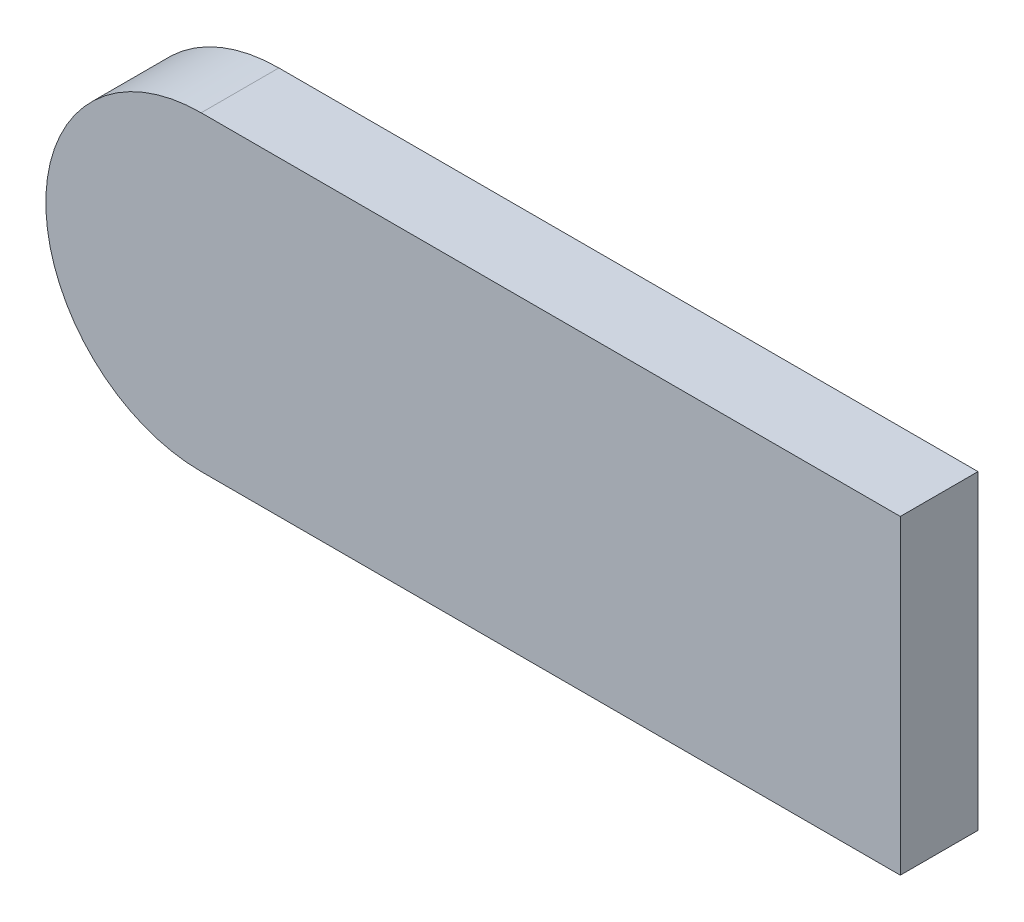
from build123d import *

# Parameters (mm, degrees)
BOSS_EXTRUDE1_DEPTH = 10


with BuildPart() as part:
    # Sketch1 → Boss-Extrude1 (new body)
    with BuildSketch(Plane.XY):
        with BuildLine():
            Line((-45, 20), (45, 20))
            Line((45, 20), (45, -20))
            Line((45, -20), (-45, -20))
            ThreePointArc((-45, -20), (-65, 0), (-45, 20))
        make_face()
    extrude(amount=BOSS_EXTRUDE1_DEPTH)


solid = part.part
